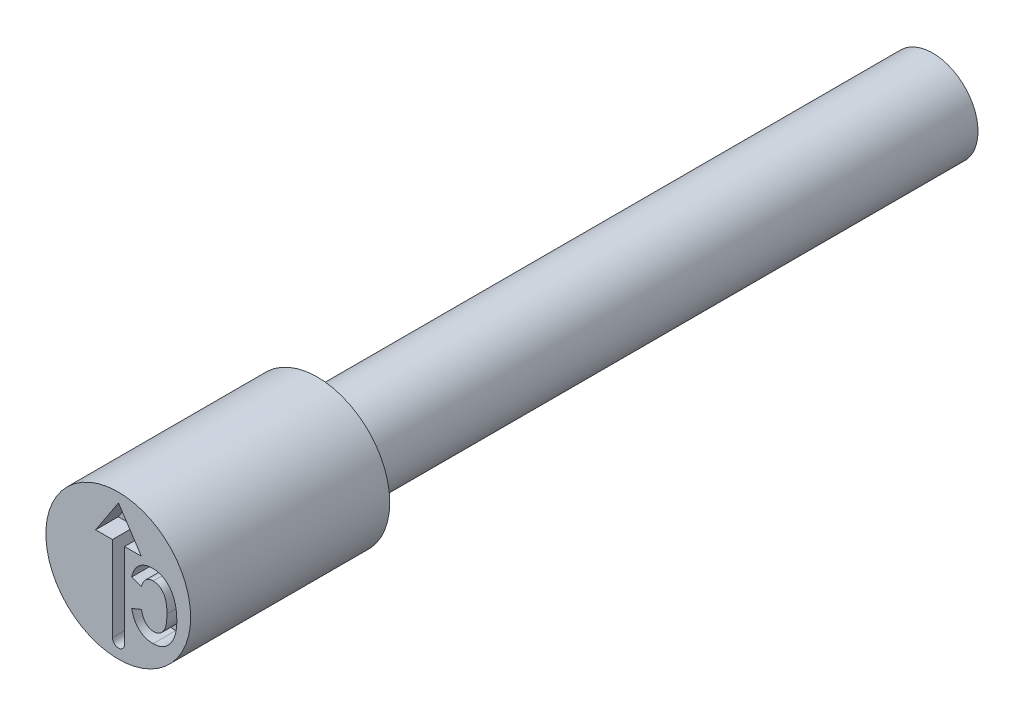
ISO-10303-21;
HEADER;
FILE_DESCRIPTION(('STEP AP214'),'2;1');
FILE_NAME('part.step','',(''),(''),'','','');
FILE_SCHEMA(('AUTOMOTIVE_DESIGN { 1 0 10303 214 1 1 1 1 }'));
ENDSEC;
DATA;
#1=APPLICATION_CONTEXT('core data for automotive mechanical design processes');
#2=APPLICATION_PROTOCOL_DEFINITION('international standard','automotive_design',2000,#1);
#3=PRODUCT_CONTEXT('',#1,'mechanical');
#4=PRODUCT('Part','Part','',(#3));
#5=PRODUCT_RELATED_PRODUCT_CATEGORY('part','',(#4));
#6=PRODUCT_DEFINITION_FORMATION('','',#4);
#7=PRODUCT_DEFINITION_CONTEXT('part definition',#1,'design');
#8=PRODUCT_DEFINITION('design','',#6,#7);
#9=PRODUCT_DEFINITION_SHAPE('','',#8);
#10=(LENGTH_UNIT() NAMED_UNIT(*) SI_UNIT(.MILLI.,.METRE.));
#11=(NAMED_UNIT(*) PLANE_ANGLE_UNIT() SI_UNIT($,.RADIAN.));
#12=(NAMED_UNIT(*) SI_UNIT($,.STERADIAN.) SOLID_ANGLE_UNIT());
#13=UNCERTAINTY_MEASURE_WITH_UNIT(LENGTH_MEASURE(1.E-05),#10,'distance_accuracy_value','');
#14=(GEOMETRIC_REPRESENTATION_CONTEXT(3) GLOBAL_UNCERTAINTY_ASSIGNED_CONTEXT((#13)) GLOBAL_UNIT_ASSIGNED_CONTEXT((#10,
#11,#12)) REPRESENTATION_CONTEXT('',''));
#15=CARTESIAN_POINT('',(0.,0.,0.));
#16=DIRECTION('',(0.,0.,1.));
#17=DIRECTION('',(1.,0.,0.));
#18=AXIS2_PLACEMENT_3D('',#15,#16,#17);
#19=CARTESIAN_POINT('',(0.,0.499999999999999,-2.2));
#20=DIRECTION('',(0.,0.,1.));
#21=DIRECTION('',(1.,0.,0.));
#22=AXIS2_PLACEMENT_3D('',#19,#20,#21);
#23=PLANE('',#22);
#24=CARTESIAN_POINT('',(0.,0.,-2.2));
#25=DIRECTION('',(0.,0.,1.));
#26=DIRECTION('',(1.,0.,0.));
#27=AXIS2_PLACEMENT_3D('',#24,#25,#26);
#28=CIRCLE('',#27,0.8);
#29=CARTESIAN_POINT('',(0.8,0.,-2.2));
#30=VERTEX_POINT('',#29);
#31=EDGE_CURVE('E11',#30,#30,#28,.T.);
#32=ORIENTED_EDGE('',*,*,#31,.F.);
#33=EDGE_LOOP('',(#32));
#34=FACE_BOUND('',#33,.T.);
#35=CARTESIAN_POINT('',(0.,0.,-2.2));
#36=DIRECTION('',(0.,0.,1.));
#37=DIRECTION('',(1.,0.,0.));
#38=AXIS2_PLACEMENT_3D('',#35,#36,#37);
#39=CIRCLE('',#38,0.499999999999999);
#40=CARTESIAN_POINT('',(0.499999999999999,0.,-2.2));
#41=VERTEX_POINT('',#40);
#42=EDGE_CURVE('E266',#41,#41,#39,.T.);
#43=ORIENTED_EDGE('',*,*,#42,.T.);
#44=EDGE_LOOP('',(#43));
#45=FACE_BOUND('',#44,.T.);
#46=ADVANCED_FACE('F35',(#34,#45),#23,.F.);
#47=CARTESIAN_POINT('',(0.,0.,-0.403888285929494));
#48=DIRECTION('',(0.,0.,1.));
#49=DIRECTION('',(1.,0.,0.));
#50=AXIS2_PLACEMENT_3D('',#47,#48,#49);
#51=CYLINDRICAL_SURFACE('',#50,0.8);
#52=CARTESIAN_POINT('',(0.,0.,0.));
#53=DIRECTION('',(0.,0.,1.));
#54=DIRECTION('',(1.,0.,0.));
#55=AXIS2_PLACEMENT_3D('',#52,#53,#54);
#56=CIRCLE('',#55,0.8);
#57=CARTESIAN_POINT('',(0.8,0.,0.));
#58=VERTEX_POINT('',#57);
#59=EDGE_CURVE('E42',#58,#58,#56,.T.);
#60=ORIENTED_EDGE('',*,*,#59,.F.);
#61=EDGE_LOOP('',(#60));
#62=FACE_BOUND('',#61,.T.);
#63=ORIENTED_EDGE('',*,*,#31,.T.);
#64=EDGE_LOOP('',(#63));
#65=FACE_BOUND('',#64,.T.);
#66=ADVANCED_FACE('F251',(#62,#65),#51,.T.);
#67=CARTESIAN_POINT('',(0.,0.8,0.));
#68=DIRECTION('',(0.,0.,-1.));
#69=DIRECTION('',(-1.,0.,0.));
#70=AXIS2_PLACEMENT_3D('',#67,#68,#69);
#71=PLANE('',#70);
#72=DIRECTION('',(-0.923076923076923,-0.384615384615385,0.));
#73=VECTOR('',#72,1.);
#74=CARTESIAN_POINT('',(0.256495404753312,-0.195454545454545,0.));
#75=LINE('',#74,#73);
#76=CARTESIAN_POINT('',(0.256495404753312,-0.195454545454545,0.));
#77=VERTEX_POINT('',#76);
#78=CARTESIAN_POINT('',(0.147404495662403,-0.240909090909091,0.));
#79=VERTEX_POINT('',#78);
#80=EDGE_CURVE('E426',#77,#79,#75,.T.);
#81=ORIENTED_EDGE('',*,*,#80,.F.);
#82=CARTESIAN_POINT('',(0.390444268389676,-0.340909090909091,0.));
#83=CARTESIAN_POINT('',(0.386510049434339,-0.340787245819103,0.));
#84=CARTESIAN_POINT('',(0.378705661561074,-0.340545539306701,0.));
#85=CARTESIAN_POINT('',(0.367221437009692,-0.339006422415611,0.));
#86=CARTESIAN_POINT('',(0.356139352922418,-0.336254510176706,0.));
#87=CARTESIAN_POINT('',(0.345457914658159,-0.332436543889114,0.));
#88=CARTESIAN_POINT('',(0.335222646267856,-0.327399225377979,0.));
#89=CARTESIAN_POINT('',(0.325328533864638,-0.321431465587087,0.));
#90=CARTESIAN_POINT('',(0.315975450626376,-0.31425815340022,0.));
#91=CARTESIAN_POINT('',(0.306920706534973,-0.306113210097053,0.));
#92=CARTESIAN_POINT('',(0.298380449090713,-0.296745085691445,0.));
#93=CARTESIAN_POINT('',(0.290575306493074,-0.285974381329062,0.));
#94=CARTESIAN_POINT('',(0.283323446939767,-0.273993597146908,0.));
#95=CARTESIAN_POINT('',(0.276668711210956,-0.260728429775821,0.));
#96=CARTESIAN_POINT('',(0.270568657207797,-0.246264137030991,0.));
#97=CARTESIAN_POINT('',(0.265190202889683,-0.230489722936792,0.));
#98=CARTESIAN_POINT('',(0.260323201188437,-0.213483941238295,0.));
#99=CARTESIAN_POINT('',(0.257795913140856,-0.201580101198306,0.));
#100=CARTESIAN_POINT('',(0.256495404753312,-0.195454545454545,0.));
#101=B_SPLINE_CURVE_WITH_KNOTS('',3,(#82,#83,#84,#85,#86,#87,#88,#89,#90,#91,#92,#93,#94,#95,
#96,#97,#98,#99,#100),.UNSPECIFIED.,.F.,.F.,(4,1,1,1,1,1,1,1,1,1,1,1,1,1,1,1,4),(0.,
0.0546275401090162,0.108365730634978,0.160503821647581,0.212906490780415,0.26553546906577,
0.318638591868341,0.373071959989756,0.428923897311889,0.48756163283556,0.548703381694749,
0.613306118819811,0.681808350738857,0.754578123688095,0.831085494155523,0.913078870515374,1.),.UNSPECIFIED.);
#102=CARTESIAN_POINT('',(0.390444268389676,-0.340909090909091,0.));
#103=VERTEX_POINT('',#102);
#104=EDGE_CURVE('E49',#103,#77,#101,.T.);
#105=ORIENTED_EDGE('',*,*,#104,.F.);
#106=CARTESIAN_POINT('',(0.538313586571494,-0.0971590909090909,0.));
#107=CARTESIAN_POINT('',(0.538158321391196,-0.107767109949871,0.));
#108=CARTESIAN_POINT('',(0.537859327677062,-0.128194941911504,0.));
#109=CARTESIAN_POINT('',(0.536116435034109,-0.157699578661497,0.));
#110=CARTESIAN_POINT('',(0.532803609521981,-0.184807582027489,0.));
#111=CARTESIAN_POINT('',(0.52856294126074,-0.209625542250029,0.));
#112=CARTESIAN_POINT('',(0.522759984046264,-0.232008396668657,0.));
#113=CARTESIAN_POINT('',(0.515670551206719,-0.251969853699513,0.));
#114=CARTESIAN_POINT('',(0.507504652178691,-0.269704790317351,0.));
#115=CARTESIAN_POINT('',(0.497763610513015,-0.284980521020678,0.));
#116=CARTESIAN_POINT('',(0.486970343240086,-0.298168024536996,0.));
#117=CARTESIAN_POINT('',(0.475495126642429,-0.309617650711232,0.));
#118=CARTESIAN_POINT('',(0.463116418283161,-0.319182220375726,0.));
#119=CARTESIAN_POINT('',(0.450165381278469,-0.327288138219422,0.));
#120=CARTESIAN_POINT('',(0.436286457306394,-0.333430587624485,0.));
#121=CARTESIAN_POINT('',(0.421643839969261,-0.337609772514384,0.));
#122=CARTESIAN_POINT('',(0.406324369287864,-0.340500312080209,0.));
#123=CARTESIAN_POINT('',(0.395808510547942,-0.340771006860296,0.));
#124=CARTESIAN_POINT('',(0.390444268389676,-0.340909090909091,0.));
#125=B_SPLINE_CURVE_WITH_KNOTS('',3,(#106,#107,#108,#109,#110,#111,#112,#113,#114,#115,#116,
#117,#118,#119,#120,#121,#122,#123,#124),.UNSPECIFIED.,.F.,.F.,(4,1,1,1,1,1,1,1,1,1,1,1,1,1,1,1,
4),(0.,0.0992738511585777,0.191171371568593,0.27641034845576,0.354719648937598,
0.426615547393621,0.492483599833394,0.552737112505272,0.608910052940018,0.661501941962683,
0.711944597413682,0.760248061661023,0.807590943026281,0.854603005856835,0.901711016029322,
0.94986183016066,1.),.UNSPECIFIED.);
#126=CARTESIAN_POINT('',(0.538313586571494,-0.0971590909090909,0.));
#127=VERTEX_POINT('',#126);
#128=EDGE_CURVE('E192',#127,#103,#125,.T.);
#129=ORIENTED_EDGE('',*,*,#128,.F.);
#130=CARTESIAN_POINT('',(0.385188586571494,0.140909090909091,0.));
#131=CARTESIAN_POINT('',(0.390689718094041,0.140745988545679,0.));
#132=CARTESIAN_POINT('',(0.401516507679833,0.140424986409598,0.));
#133=CARTESIAN_POINT('',(0.417378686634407,0.137871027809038,0.));
#134=CARTESIAN_POINT('',(0.43238646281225,0.133353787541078,0.));
#135=CARTESIAN_POINT('',(0.446765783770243,0.127423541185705,0.));
#136=CARTESIAN_POINT('',(0.460275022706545,0.11952268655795,0.));
#137=CARTESIAN_POINT('',(0.473064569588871,0.109954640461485,0.));
#138=CARTESIAN_POINT('',(0.484790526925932,0.0984302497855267,0.));
#139=CARTESIAN_POINT('',(0.496028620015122,0.0854672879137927,0.));
#140=CARTESIAN_POINT('',(0.506212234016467,0.0704480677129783,0.));
#141=CARTESIAN_POINT('',(0.514858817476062,0.0530898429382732,0.));
#142=CARTESIAN_POINT('',(0.521990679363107,0.0334545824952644,0.));
#143=CARTESIAN_POINT('',(0.52813393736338,0.0116831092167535,0.));
#144=CARTESIAN_POINT('',(0.532730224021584,-0.0123676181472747,0.));
#145=CARTESIAN_POINT('',(0.535919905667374,-0.0386603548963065,0.));
#146=CARTESIAN_POINT('',(0.537910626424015,-0.0671569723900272,0.));
#147=CARTESIAN_POINT('',(0.538176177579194,-0.0869283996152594,0.));
#148=CARTESIAN_POINT('',(0.538313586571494,-0.0971590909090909,0.));
#149=B_SPLINE_CURVE_WITH_KNOTS('',3,(#130,#131,#132,#133,#134,#135,#136,#137,#138,#139,#140,
#141,#142,#143,#144,#145,#146,#147,#148),.UNSPECIFIED.,.F.,.F.,(4,1,1,1,1,1,1,1,1,1,1,1,1,1,1,1,
4),(0.,0.0517304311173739,0.101810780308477,0.150568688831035,0.198872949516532,
0.247760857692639,0.29737366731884,0.348713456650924,0.402091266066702,0.458540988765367,
0.518889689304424,0.583994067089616,0.65477355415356,0.731460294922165,0.814043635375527,
0.903777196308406,1.),.UNSPECIFIED.);
#150=CARTESIAN_POINT('',(0.385188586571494,0.140909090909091,0.));
#151=VERTEX_POINT('',#150);
#152=EDGE_CURVE('E195',#151,#127,#149,.T.);
#153=ORIENTED_EDGE('',*,*,#152,.F.);
#154=CARTESIAN_POINT('',(0.256495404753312,0.0227272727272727,0.));
#155=CARTESIAN_POINT('',(0.257520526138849,0.0273831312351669,0.));
#156=CARTESIAN_POINT('',(0.25951524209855,0.0364426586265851,0.));
#157=CARTESIAN_POINT('',(0.263520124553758,0.0495167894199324,0.));
#158=CARTESIAN_POINT('',(0.268395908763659,0.0616600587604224,0.));
#159=CARTESIAN_POINT('',(0.273700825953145,0.0731639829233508,0.));
#160=CARTESIAN_POINT('',(0.280088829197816,0.0836306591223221,0.));
#161=CARTESIAN_POINT('',(0.286770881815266,0.0935601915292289,0.));
#162=CARTESIAN_POINT('',(0.294606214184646,0.102357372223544,0.));
#163=CARTESIAN_POINT('',(0.302884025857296,0.110484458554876,0.));
#164=CARTESIAN_POINT('',(0.311896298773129,0.117507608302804,0.));
#165=CARTESIAN_POINT('',(0.321121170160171,0.123858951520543,0.));
#166=CARTESIAN_POINT('',(0.330833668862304,0.129139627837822,0.));
#167=CARTESIAN_POINT('',(0.340993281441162,0.133386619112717,0.));
#168=CARTESIAN_POINT('',(0.351479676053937,0.136823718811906,0.));
#169=CARTESIAN_POINT('',(0.362370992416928,0.139240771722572,0.));
#170=CARTESIAN_POINT('',(0.373642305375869,0.140704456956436,0.));
#171=CARTESIAN_POINT('',(0.381301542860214,0.140840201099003,0.));
#172=CARTESIAN_POINT('',(0.385188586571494,0.140909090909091,0.));
#173=B_SPLINE_CURVE_WITH_KNOTS('',3,(#154,#155,#156,#157,#158,#159,#160,#161,#162,#163,#164,
#165,#166,#167,#168,#169,#170,#171,#172),.UNSPECIFIED.,.F.,.F.,(4,1,1,1,1,1,1,1,1,1,1,1,1,1,1,1,
4),(0.,0.0750044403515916,0.145946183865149,0.214851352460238,0.28084266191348,
0.344991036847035,0.407619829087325,0.468881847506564,0.530007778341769,0.589936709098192,
0.648421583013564,0.706103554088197,0.763534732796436,0.821499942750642,0.879527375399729,
0.938860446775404,1.),.UNSPECIFIED.);
#174=CARTESIAN_POINT('',(0.256495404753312,0.0227272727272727,0.));
#175=VERTEX_POINT('',#174);
#176=EDGE_CURVE('E359',#175,#151,#173,.T.);
#177=ORIENTED_EDGE('',*,*,#176,.F.);
#178=DIRECTION('',(0.948683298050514,-0.316227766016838,0.));
#179=VECTOR('',#178,1.);
#180=CARTESIAN_POINT('',(0.147404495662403,0.0590909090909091,0.));
#181=LINE('',#180,#179);
#182=CARTESIAN_POINT('',(0.147404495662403,0.0590909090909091,0.));
#183=VERTEX_POINT('',#182);
#184=EDGE_CURVE('E367',#183,#175,#181,.T.);
#185=ORIENTED_EDGE('',*,*,#184,.F.);
#186=CARTESIAN_POINT('',(0.215444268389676,0.194744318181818,0.));
#187=CARTESIAN_POINT('',(0.211629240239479,0.190785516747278,0.));
#188=CARTESIAN_POINT('',(0.203855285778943,0.182718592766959,0.));
#189=CARTESIAN_POINT('',(0.19338763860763,0.169130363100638,0.));
#190=CARTESIAN_POINT('',(0.183696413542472,0.154165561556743,0.));
#191=CARTESIAN_POINT('',(0.174955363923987,0.137760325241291,0.));
#192=CARTESIAN_POINT('',(0.166829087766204,0.120074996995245,0.));
#193=CARTESIAN_POINT('',(0.159439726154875,0.101018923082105,0.));
#194=CARTESIAN_POINT('',(0.152939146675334,0.0805487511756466,0.));
#195=CARTESIAN_POINT('',(0.149277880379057,0.0663540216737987,0.));
#196=CARTESIAN_POINT('',(0.147404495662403,0.0590909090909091,0.));
#197=B_SPLINE_CURVE_WITH_KNOTS('',3,(#186,#187,#188,#189,#190,#191,#192,#193,#194,#195,#196),
.UNSPECIFIED.,.F.,.F.,(4,1,1,1,1,1,1,1,4),(0.,0.107250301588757,0.218545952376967,
0.334163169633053,0.454912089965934,0.581044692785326,0.713889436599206,0.853603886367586,1.),.UNSPECIFIED.);
#198=CARTESIAN_POINT('',(0.215444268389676,0.194744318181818,0.));
#199=VERTEX_POINT('',#198);
#200=EDGE_CURVE('E373',#199,#183,#197,.T.);
#201=ORIENTED_EDGE('',*,*,#200,.F.);
#202=CARTESIAN_POINT('',(0.377234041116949,0.259090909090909,0.));
#203=CARTESIAN_POINT('',(0.369318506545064,0.25890144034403,0.));
#204=CARTESIAN_POINT('',(0.353760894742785,0.258529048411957,0.));
#205=CARTESIAN_POINT('',(0.330948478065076,0.255551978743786,0.));
#206=CARTESIAN_POINT('',(0.309214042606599,0.250317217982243,0.));
#207=CARTESIAN_POINT('',(0.288345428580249,0.243450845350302,0.));
#208=CARTESIAN_POINT('',(0.268525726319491,0.234263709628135,0.));
#209=CARTESIAN_POINT('',(0.24969762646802,0.223115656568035,0.));
#210=CARTESIAN_POINT('',(0.231787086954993,0.210043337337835,0.));
#211=CARTESIAN_POINT('',(0.220931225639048,0.199880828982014,0.));
#212=CARTESIAN_POINT('',(0.215444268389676,0.194744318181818,0.));
#213=B_SPLINE_CURVE_WITH_KNOTS('',3,(#202,#203,#204,#205,#206,#207,#208,#209,#210,#211,#212),
.UNSPECIFIED.,.F.,.F.,(4,1,1,1,1,1,1,1,4),(0.,0.13277178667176,0.260956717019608,
0.385037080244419,0.507368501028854,0.62892376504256,0.750714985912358,0.874002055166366,1.),.UNSPECIFIED.);
#214=CARTESIAN_POINT('',(0.377234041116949,0.259090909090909,0.));
#215=VERTEX_POINT('',#214);
#216=EDGE_CURVE('E378',#215,#199,#213,.T.);
#217=ORIENTED_EDGE('',*,*,#216,.F.);
#218=CARTESIAN_POINT('',(0.566438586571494,0.171875,0.));
#219=CARTESIAN_POINT('',(0.560486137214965,0.178840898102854,0.));
#220=CARTESIAN_POINT('',(0.548755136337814,0.192569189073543,0.));
#221=CARTESIAN_POINT('',(0.528704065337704,0.210346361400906,0.));
#222=CARTESIAN_POINT('',(0.507162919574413,0.225457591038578,0.));
#223=CARTESIAN_POINT('',(0.484139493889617,0.237829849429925,0.));
#224=CARTESIAN_POINT('',(0.459530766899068,0.247452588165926,0.));
#225=CARTESIAN_POINT('',(0.433457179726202,0.25424254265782,0.));
#226=CARTESIAN_POINT('',(0.4058143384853,0.258248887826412,0.));
#227=CARTESIAN_POINT('',(0.386906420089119,0.258805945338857,0.));
#228=CARTESIAN_POINT('',(0.377234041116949,0.259090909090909,0.));
#229=B_SPLINE_CURVE_WITH_KNOTS('',3,(#218,#219,#220,#221,#222,#223,#224,#225,#226,#227,#228),
.UNSPECIFIED.,.F.,.F.,(4,1,1,1,1,1,1,1,4),(0.,0.127182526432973,0.250649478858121,
0.371100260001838,0.492067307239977,0.612885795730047,0.737344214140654,0.86563796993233,1.),.UNSPECIFIED.);
#230=CARTESIAN_POINT('',(0.566438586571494,0.171875,0.));
#231=VERTEX_POINT('',#230);
#232=EDGE_CURVE('E386',#231,#215,#229,.T.);
#233=ORIENTED_EDGE('',*,*,#232,.F.);
#234=CARTESIAN_POINT('',(0.647404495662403,-0.106107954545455,0.));
#235=CARTESIAN_POINT('',(0.64717817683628,-0.0917040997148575,0.));
#236=CARTESIAN_POINT('',(0.646737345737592,-0.0636478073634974,0.));
#237=CARTESIAN_POINT('',(0.642768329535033,-0.0228005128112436,0.));
#238=CARTESIAN_POINT('',(0.636717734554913,0.0157087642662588,0.));
#239=CARTESIAN_POINT('',(0.627696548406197,0.0517368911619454,0.));
#240=CARTESIAN_POINT('',(0.616395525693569,0.0854907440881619,0.));
#241=CARTESIAN_POINT('',(0.602433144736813,0.116759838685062,0.));
#242=CARTESIAN_POINT('',(0.586221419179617,0.145871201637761,0.));
#243=CARTESIAN_POINT('',(0.572994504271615,0.163257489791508,0.));
#244=CARTESIAN_POINT('',(0.566438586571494,0.171875,0.));
#245=B_SPLINE_CURVE_WITH_KNOTS('',3,(#234,#235,#236,#237,#238,#239,#240,#241,#242,#243,#244),
.UNSPECIFIED.,.F.,.F.,(4,1,1,1,1,1,1,1,4),(0.,0.146387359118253,0.285138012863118,
0.416810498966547,0.542304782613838,0.662246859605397,0.778169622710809,0.89004981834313,1.),.UNSPECIFIED.);
#246=CARTESIAN_POINT('',(0.647404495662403,-0.106107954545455,0.));
#247=VERTEX_POINT('',#246);
#248=EDGE_CURVE('E394',#247,#231,#245,.T.);
#249=ORIENTED_EDGE('',*,*,#248,.F.);
#250=CARTESIAN_POINT('',(0.567148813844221,-0.373295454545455,0.));
#251=CARTESIAN_POINT('',(0.573580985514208,-0.364802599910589,0.));
#252=CARTESIAN_POINT('',(0.586539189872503,-0.347692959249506,0.));
#253=CARTESIAN_POINT('',(0.602807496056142,-0.319479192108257,0.));
#254=CARTESIAN_POINT('',(0.61664400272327,-0.289168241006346,0.));
#255=CARTESIAN_POINT('',(0.627968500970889,-0.256732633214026,0.));
#256=CARTESIAN_POINT('',(0.636795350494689,-0.22213643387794,0.));
#257=CARTESIAN_POINT('',(0.642966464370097,-0.185363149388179,0.));
#258=CARTESIAN_POINT('',(0.646672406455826,-0.146430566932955,0.));
#259=CARTESIAN_POINT('',(0.64715676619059,-0.119752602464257,0.));
#260=CARTESIAN_POINT('',(0.647404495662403,-0.106107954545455,0.));
#261=B_SPLINE_CURVE_WITH_KNOTS('',3,(#250,#251,#252,#253,#254,#255,#256,#257,#258,#259,#260),
.UNSPECIFIED.,.F.,.F.,(4,1,1,1,1,1,1,1,4),(0.,0.112267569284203,0.226173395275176,
0.342589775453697,0.463245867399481,0.587990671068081,0.71868225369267,0.856117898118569,1.),.UNSPECIFIED.);
#262=CARTESIAN_POINT('',(0.567148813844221,-0.373295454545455,0.));
#263=VERTEX_POINT('',#262);
#264=EDGE_CURVE('E402',#263,#247,#261,.T.);
#265=ORIENTED_EDGE('',*,*,#264,.F.);
#266=CARTESIAN_POINT('',(0.385188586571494,-0.459090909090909,0.));
#267=CARTESIAN_POINT('',(0.39434478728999,-0.45888505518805,0.));
#268=CARTESIAN_POINT('',(0.412281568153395,-0.458481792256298,0.));
#269=CARTESIAN_POINT('',(0.438454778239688,-0.454142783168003,0.));
#270=CARTESIAN_POINT('',(0.463360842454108,-0.447550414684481,0.));
#271=CARTESIAN_POINT('',(0.486954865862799,-0.438083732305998,0.));
#272=CARTESIAN_POINT('',(0.50926482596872,-0.425983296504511,0.));
#273=CARTESIAN_POINT('',(0.530055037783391,-0.410995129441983,0.));
#274=CARTESIAN_POINT('',(0.54981062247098,-0.393677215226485,0.));
#275=CARTESIAN_POINT('',(0.561297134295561,-0.38017434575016,0.));
#276=CARTESIAN_POINT('',(0.567148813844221,-0.373295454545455,0.));
#277=B_SPLINE_CURVE_WITH_KNOTS('',3,(#266,#267,#268,#269,#270,#271,#272,#273,#274,#275,#276),
.UNSPECIFIED.,.F.,.F.,(4,1,1,1,1,1,1,1,4),(0.,0.131676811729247,0.257951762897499,
0.380786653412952,0.501900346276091,0.622975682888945,0.745141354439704,0.870165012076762,1.),.UNSPECIFIED.);
#278=CARTESIAN_POINT('',(0.385188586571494,-0.459090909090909,0.));
#279=VERTEX_POINT('',#278);
#280=EDGE_CURVE('E410',#279,#263,#277,.T.);
#281=ORIENTED_EDGE('',*,*,#280,.F.);
#282=CARTESIAN_POINT('',(0.147404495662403,-0.240909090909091,0.));
#283=CARTESIAN_POINT('',(0.149657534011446,-0.250079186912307,0.));
#284=CARTESIAN_POINT('',(0.154047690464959,-0.267947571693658,0.));
#285=CARTESIAN_POINT('',(0.162353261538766,-0.293486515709,0.));
#286=CARTESIAN_POINT('',(0.17149259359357,-0.317182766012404,0.));
#287=CARTESIAN_POINT('',(0.181948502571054,-0.338903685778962,0.));
#288=CARTESIAN_POINT('',(0.193362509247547,-0.358839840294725,0.));
#289=CARTESIAN_POINT('',(0.206041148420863,-0.376795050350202,0.));
#290=CARTESIAN_POINT('',(0.219745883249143,-0.392861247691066,0.));
#291=CARTESIAN_POINT('',(0.234554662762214,-0.407000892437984,0.));
#292=CARTESIAN_POINT('',(0.250443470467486,-0.419166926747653,0.));
#293=CARTESIAN_POINT('',(0.266966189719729,-0.430008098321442,0.));
#294=CARTESIAN_POINT('',(0.284549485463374,-0.438895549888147,0.));
#295=CARTESIAN_POINT('',(0.302947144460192,-0.446399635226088,0.));
#296=CARTESIAN_POINT('',(0.322303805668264,-0.451977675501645,0.));
#297=CARTESIAN_POINT('',(0.342472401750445,-0.456175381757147,0.));
#298=CARTESIAN_POINT('',(0.363539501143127,-0.458577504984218,0.));
#299=CARTESIAN_POINT('',(0.377891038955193,-0.458917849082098,0.));
#300=CARTESIAN_POINT('',(0.385188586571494,-0.459090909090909,0.));
#301=B_SPLINE_CURVE_WITH_KNOTS('',3,(#282,#283,#284,#285,#286,#287,#288,#289,#290,#291,#292,
#293,#294,#295,#296,#297,#298,#299,#300),.UNSPECIFIED.,.F.,.F.,(4,1,1,1,1,1,1,1,1,1,1,1,1,1,1,1,
4),(0.,0.080161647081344,0.156198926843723,0.227877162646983,0.295674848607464,0.36070738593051,
0.422732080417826,0.482042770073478,0.539774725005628,0.596232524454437,0.651772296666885,
0.707336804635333,0.763259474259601,0.820257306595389,0.878136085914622,0.938033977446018,1.),.UNSPECIFIED.);
#302=EDGE_CURVE('E418',#79,#279,#301,.T.);
#303=ORIENTED_EDGE('',*,*,#302,.F.);
#304=EDGE_LOOP('',(#81,#105,#129,#153,#177,#185,#201,#217,#233,#249,#265,#281,#303));
#305=FACE_BOUND('',#304,.T.);
#306=DIRECTION('',(0.,1.,0.));
#307=VECTOR('',#306,1.);
#308=CARTESIAN_POINT('',(0.0691688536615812,0.312374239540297,0.));
#309=LINE('',#308,#307);
#310=CARTESIAN_POINT('',(0.0691688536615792,-0.626505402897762,0.));
#311=VERTEX_POINT('',#310);
#312=CARTESIAN_POINT('',(0.0691688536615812,0.312374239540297,0.));
#313=VERTEX_POINT('',#312);
#314=EDGE_CURVE('E304',#311,#313,#309,.T.);
#315=ORIENTED_EDGE('',*,*,#314,.F.);
#316=CARTESIAN_POINT('',(0.00250326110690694,-0.626505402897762,0.));
#317=DIRECTION('',(0.,0.,1.));
#318=DIRECTION('',(1.,0.,0.));
#319=AXIS2_PLACEMENT_3D('',#316,#317,#318);
#320=CIRCLE('',#319,0.0666655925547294);
#321=CARTESIAN_POINT('',(-0.0641623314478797,-0.626505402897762,0.));
#322=VERTEX_POINT('',#321);
#323=EDGE_CURVE('E57',#322,#311,#320,.T.);
#324=ORIENTED_EDGE('',*,*,#323,.F.);
#325=DIRECTION('',(0.,-1.,0.));
#326=VECTOR('',#325,1.);
#327=CARTESIAN_POINT('',(-0.0641623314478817,0.312374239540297,0.));
#328=LINE('',#327,#326);
#329=CARTESIAN_POINT('',(-0.0641623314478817,0.312374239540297,0.));
#330=VERTEX_POINT('',#329);
#331=EDGE_CURVE('E288',#330,#322,#328,.T.);
#332=ORIENTED_EDGE('',*,*,#331,.F.);
#333=DIRECTION('',(1.,0.,0.));
#334=VECTOR('',#333,1.);
#335=CARTESIAN_POINT('',(-0.250167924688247,0.312374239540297,0.));
#336=LINE('',#335,#334);
#337=CARTESIAN_POINT('',(-0.250167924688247,0.312374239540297,0.));
#338=VERTEX_POINT('',#337);
#339=EDGE_CURVE('E292',#338,#330,#336,.T.);
#340=ORIENTED_EDGE('',*,*,#339,.F.);
#341=DIRECTION('',(-0.550159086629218,-0.835059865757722,0.));
#342=VECTOR('',#341,1.);
#343=CARTESIAN_POINT('',(0.00250326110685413,0.69589161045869,0.));
#344=LINE('',#343,#342);
#345=CARTESIAN_POINT('',(0.00250326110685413,0.69589161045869,0.));
#346=VERTEX_POINT('',#345);
#347=EDGE_CURVE('E295',#346,#338,#344,.T.);
#348=ORIENTED_EDGE('',*,*,#347,.F.);
#349=DIRECTION('',(-0.550159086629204,0.835059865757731,0.));
#350=VECTOR('',#349,1.);
#351=CARTESIAN_POINT('',(0.00250326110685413,0.69589161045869,0.));
#352=LINE('',#351,#350);
#353=CARTESIAN_POINT('',(0.255174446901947,0.312374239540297,0.));
#354=VERTEX_POINT('',#353);
#355=EDGE_CURVE('E298',#354,#346,#352,.T.);
#356=ORIENTED_EDGE('',*,*,#355,.F.);
#357=DIRECTION('',(1.,0.,0.));
#358=VECTOR('',#357,1.);
#359=CARTESIAN_POINT('',(0.255174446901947,0.312374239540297,0.));
#360=LINE('',#359,#358);
#361=EDGE_CURVE('E301',#313,#354,#360,.T.);
#362=ORIENTED_EDGE('',*,*,#361,.F.);
#363=EDGE_LOOP('',(#315,#324,#332,#340,#348,#356,#362));
#364=FACE_BOUND('',#363,.T.);
#365=ORIENTED_EDGE('',*,*,#59,.T.);
#366=EDGE_LOOP('',(#365));
#367=FACE_BOUND('',#366,.T.);
#368=ADVANCED_FACE('F248',(#305,#364,#367),#71,.F.);
#369=CARTESIAN_POINT('',(0.,0.,-9.));
#370=DIRECTION('',(0.,0.,1.));
#371=DIRECTION('',(1.,0.,0.));
#372=AXIS2_PLACEMENT_3D('',#369,#370,#371);
#373=PLANE('',#372);
#374=CARTESIAN_POINT('',(0.,0.,-9.));
#375=DIRECTION('',(0.,0.,1.));
#376=DIRECTION('',(1.,0.,0.));
#377=AXIS2_PLACEMENT_3D('',#374,#375,#376);
#378=CIRCLE('',#377,0.5);
#379=CARTESIAN_POINT('',(0.5,0.,-9.));
#380=VERTEX_POINT('',#379);
#381=EDGE_CURVE('E267',#380,#380,#378,.T.);
#382=ORIENTED_EDGE('',*,*,#381,.F.);
#383=EDGE_LOOP('',(#382));
#384=FACE_BOUND('',#383,.T.);
#385=ADVANCED_FACE('F244',(#384),#373,.F.);
#386=CARTESIAN_POINT('',(0.,0.,-0.403888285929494));
#387=DIRECTION('',(0.,0.,1.));
#388=DIRECTION('',(1.,0.,0.));
#389=AXIS2_PLACEMENT_3D('',#386,#387,#388);
#390=CYLINDRICAL_SURFACE('',#389,0.5);
#391=ORIENTED_EDGE('',*,*,#42,.F.);
#392=EDGE_LOOP('',(#391));
#393=FACE_BOUND('',#392,.T.);
#394=ORIENTED_EDGE('',*,*,#381,.T.);
#395=EDGE_LOOP('',(#394));
#396=FACE_BOUND('',#395,.T.);
#397=ADVANCED_FACE('F241',(#393,#396),#390,.T.);
#398=CARTESIAN_POINT('',(0.00250326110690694,-0.626505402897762,-0.25));
#399=DIRECTION('',(0.,0.,1.));
#400=DIRECTION('',(1.,0.,0.));
#401=AXIS2_PLACEMENT_3D('',#398,#399,#400);
#402=CYLINDRICAL_SURFACE('',#401,0.0666655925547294);
#403=ORIENTED_EDGE('',*,*,#323,.T.);
#404=DIRECTION('',(0.,0.,1.));
#405=VECTOR('',#404,1.);
#406=CARTESIAN_POINT('',(0.0691688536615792,-0.626505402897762,-0.25));
#407=LINE('',#406,#405);
#408=CARTESIAN_POINT('',(0.0691688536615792,-0.626505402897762,-0.25));
#409=VERTEX_POINT('',#408);
#410=EDGE_CURVE('E275',#409,#311,#407,.T.);
#411=ORIENTED_EDGE('',*,*,#410,.F.);
#412=CARTESIAN_POINT('',(0.00250326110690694,-0.626505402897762,-0.25));
#413=DIRECTION('',(0.,0.,1.));
#414=DIRECTION('',(1.,0.,0.));
#415=AXIS2_PLACEMENT_3D('',#412,#413,#414);
#416=CIRCLE('',#415,0.0666655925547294);
#417=CARTESIAN_POINT('',(-0.0641623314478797,-0.626505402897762,-0.25));
#418=VERTEX_POINT('',#417);
#419=EDGE_CURVE('E291',#418,#409,#416,.T.);
#420=ORIENTED_EDGE('',*,*,#419,.F.);
#421=DIRECTION('',(0.,0.,1.));
#422=VECTOR('',#421,1.);
#423=CARTESIAN_POINT('',(-0.0641623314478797,-0.626505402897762,-0.25));
#424=LINE('',#423,#422);
#425=EDGE_CURVE('E268',#418,#322,#424,.T.);
#426=ORIENTED_EDGE('',*,*,#425,.T.);
#427=EDGE_LOOP('',(#403,#411,#420,#426));
#428=FACE_BOUND('',#427,.T.);
#429=ADVANCED_FACE('F219',(#428),#402,.F.);
#430=CARTESIAN_POINT('',(-0.0641623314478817,0.312374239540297,-0.25));
#431=DIRECTION('',(-1.,0.,0.));
#432=DIRECTION('',(0.,-1.,0.));
#433=AXIS2_PLACEMENT_3D('',#430,#431,#432);
#434=PLANE('',#433);
#435=ORIENTED_EDGE('',*,*,#331,.T.);
#436=ORIENTED_EDGE('',*,*,#425,.F.);
#437=DIRECTION('',(0.,-1.,0.));
#438=VECTOR('',#437,1.);
#439=CARTESIAN_POINT('',(-0.0641623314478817,0.312374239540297,-0.25));
#440=LINE('',#439,#438);
#441=CARTESIAN_POINT('',(-0.0641623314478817,0.312374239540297,-0.25));
#442=VERTEX_POINT('',#441);
#443=EDGE_CURVE('E279',#442,#418,#440,.T.);
#444=ORIENTED_EDGE('',*,*,#443,.F.);
#445=DIRECTION('',(0.,0.,1.));
#446=VECTOR('',#445,1.);
#447=CARTESIAN_POINT('',(-0.0641623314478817,0.312374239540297,-0.25));
#448=LINE('',#447,#446);
#449=EDGE_CURVE('E272',#442,#330,#448,.T.);
#450=ORIENTED_EDGE('',*,*,#449,.T.);
#451=EDGE_LOOP('',(#435,#436,#444,#450));
#452=FACE_BOUND('',#451,.T.);
#453=ADVANCED_FACE('F215',(#452),#434,.F.);
#454=CARTESIAN_POINT('',(-0.250167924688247,0.312374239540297,-0.25));
#455=DIRECTION('',(0.,-1.,0.));
#456=DIRECTION('',(0.,0.,-1.));
#457=AXIS2_PLACEMENT_3D('',#454,#455,#456);
#458=PLANE('',#457);
#459=ORIENTED_EDGE('',*,*,#339,.T.);
#460=ORIENTED_EDGE('',*,*,#449,.F.);
#461=DIRECTION('',(1.,0.,0.));
#462=VECTOR('',#461,1.);
#463=CARTESIAN_POINT('',(-0.250167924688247,0.312374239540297,-0.25));
#464=LINE('',#463,#462);
#465=CARTESIAN_POINT('',(-0.250167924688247,0.312374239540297,-0.25));
#466=VERTEX_POINT('',#465);
#467=EDGE_CURVE('E311',#466,#442,#464,.T.);
#468=ORIENTED_EDGE('',*,*,#467,.F.);
#469=DIRECTION('',(0.,0.,1.));
#470=VECTOR('',#469,1.);
#471=CARTESIAN_POINT('',(-0.250167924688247,0.312374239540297,-0.25));
#472=LINE('',#471,#470);
#473=EDGE_CURVE('E285',#466,#338,#472,.T.);
#474=ORIENTED_EDGE('',*,*,#473,.T.);
#475=EDGE_LOOP('',(#459,#460,#468,#474));
#476=FACE_BOUND('',#475,.T.);
#477=ADVANCED_FACE('F218',(#476),#458,.F.);
#478=CARTESIAN_POINT('',(0.00250326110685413,0.69589161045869,-0.25));
#479=DIRECTION('',(-0.835059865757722,0.550159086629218,0.));
#480=DIRECTION('',(-0.550159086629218,-0.835059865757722,0.));
#481=AXIS2_PLACEMENT_3D('',#478,#479,#480);
#482=PLANE('',#481);
#483=ORIENTED_EDGE('',*,*,#347,.T.);
#484=ORIENTED_EDGE('',*,*,#473,.F.);
#485=DIRECTION('',(-0.550159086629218,-0.835059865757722,0.));
#486=VECTOR('',#485,1.);
#487=CARTESIAN_POINT('',(0.00250326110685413,0.69589161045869,-0.25));
#488=LINE('',#487,#486);
#489=CARTESIAN_POINT('',(0.00250326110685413,0.69589161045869,-0.25));
#490=VERTEX_POINT('',#489);
#491=EDGE_CURVE('E314',#490,#466,#488,.T.);
#492=ORIENTED_EDGE('',*,*,#491,.F.);
#493=DIRECTION('',(0.,0.,1.));
#494=VECTOR('',#493,1.);
#495=CARTESIAN_POINT('',(0.00250326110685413,0.69589161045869,-0.25));
#496=LINE('',#495,#494);
#497=EDGE_CURVE('E283',#490,#346,#496,.T.);
#498=ORIENTED_EDGE('',*,*,#497,.T.);
#499=EDGE_LOOP('',(#483,#484,#492,#498));
#500=FACE_BOUND('',#499,.T.);
#501=ADVANCED_FACE('F223',(#500),#482,.F.);
#502=CARTESIAN_POINT('',(0.00250326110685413,0.69589161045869,-0.25));
#503=DIRECTION('',(0.835059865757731,0.550159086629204,0.));
#504=DIRECTION('',(-0.550159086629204,0.835059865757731,0.));
#505=AXIS2_PLACEMENT_3D('',#502,#503,#504);
#506=PLANE('',#505);
#507=ORIENTED_EDGE('',*,*,#355,.T.);
#508=ORIENTED_EDGE('',*,*,#497,.F.);
#509=DIRECTION('',(-0.550159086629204,0.835059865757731,0.));
#510=VECTOR('',#509,1.);
#511=CARTESIAN_POINT('',(0.00250326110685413,0.69589161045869,-0.25));
#512=LINE('',#511,#510);
#513=CARTESIAN_POINT('',(0.255174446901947,0.312374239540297,-0.25));
#514=VERTEX_POINT('',#513);
#515=EDGE_CURVE('E317',#514,#490,#512,.T.);
#516=ORIENTED_EDGE('',*,*,#515,.F.);
#517=DIRECTION('',(0.,0.,1.));
#518=VECTOR('',#517,1.);
#519=CARTESIAN_POINT('',(0.255174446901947,0.312374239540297,-0.25));
#520=LINE('',#519,#518);
#521=EDGE_CURVE('E281',#514,#354,#520,.T.);
#522=ORIENTED_EDGE('',*,*,#521,.T.);
#523=EDGE_LOOP('',(#507,#508,#516,#522));
#524=FACE_BOUND('',#523,.T.);
#525=ADVANCED_FACE('F227',(#524),#506,.F.);
#526=CARTESIAN_POINT('',(0.255174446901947,0.312374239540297,-0.25));
#527=DIRECTION('',(0.,-1.,0.));
#528=DIRECTION('',(0.,0.,-1.));
#529=AXIS2_PLACEMENT_3D('',#526,#527,#528);
#530=PLANE('',#529);
#531=ORIENTED_EDGE('',*,*,#361,.T.);
#532=ORIENTED_EDGE('',*,*,#521,.F.);
#533=DIRECTION('',(1.,0.,0.));
#534=VECTOR('',#533,1.);
#535=CARTESIAN_POINT('',(0.255174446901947,0.312374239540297,-0.25));
#536=LINE('',#535,#534);
#537=CARTESIAN_POINT('',(0.0691688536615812,0.312374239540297,-0.25));
#538=VERTEX_POINT('',#537);
#539=EDGE_CURVE('E320',#538,#514,#536,.T.);
#540=ORIENTED_EDGE('',*,*,#539,.F.);
#541=DIRECTION('',(0.,0.,1.));
#542=VECTOR('',#541,1.);
#543=CARTESIAN_POINT('',(0.0691688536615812,0.312374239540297,-0.25));
#544=LINE('',#543,#542);
#545=EDGE_CURVE('E278',#538,#313,#544,.T.);
#546=ORIENTED_EDGE('',*,*,#545,.T.);
#547=EDGE_LOOP('',(#531,#532,#540,#546));
#548=FACE_BOUND('',#547,.T.);
#549=ADVANCED_FACE('F231',(#548),#530,.F.);
#550=CARTESIAN_POINT('',(0.0691688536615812,0.312374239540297,-0.25));
#551=DIRECTION('',(1.,0.,0.));
#552=DIRECTION('',(0.,1.,0.));
#553=AXIS2_PLACEMENT_3D('',#550,#551,#552);
#554=PLANE('',#553);
#555=ORIENTED_EDGE('',*,*,#314,.T.);
#556=ORIENTED_EDGE('',*,*,#545,.F.);
#557=DIRECTION('',(0.,1.,0.));
#558=VECTOR('',#557,1.);
#559=CARTESIAN_POINT('',(0.0691688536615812,0.312374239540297,-0.25));
#560=LINE('',#559,#558);
#561=EDGE_CURVE('E323',#409,#538,#560,.T.);
#562=ORIENTED_EDGE('',*,*,#561,.F.);
#563=ORIENTED_EDGE('',*,*,#410,.T.);
#564=EDGE_LOOP('',(#555,#556,#562,#563));
#565=FACE_BOUND('',#564,.T.);
#566=ADVANCED_FACE('F213',(#565),#554,.F.);
#567=CARTESIAN_POINT('',(0.00250326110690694,-0.626505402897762,-0.25));
#568=DIRECTION('',(0.,0.,1.));
#569=DIRECTION('',(1.,0.,0.));
#570=AXIS2_PLACEMENT_3D('',#567,#568,#569);
#571=PLANE('',#570);
#572=ORIENTED_EDGE('',*,*,#419,.T.);
#573=ORIENTED_EDGE('',*,*,#561,.T.);
#574=ORIENTED_EDGE('',*,*,#539,.T.);
#575=ORIENTED_EDGE('',*,*,#515,.T.);
#576=ORIENTED_EDGE('',*,*,#491,.T.);
#577=ORIENTED_EDGE('',*,*,#467,.T.);
#578=ORIENTED_EDGE('',*,*,#443,.T.);
#579=EDGE_LOOP('',(#572,#573,#574,#575,#576,#577,#578));
#580=FACE_BOUND('',#579,.T.);
#581=ADVANCED_FACE('F209',(#580),#571,.T.);
#582=CARTESIAN_POINT('',(0.390444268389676,-0.340909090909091,-0.25));
#583=CARTESIAN_POINT('',(0.386510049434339,-0.340787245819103,-0.25));
#584=CARTESIAN_POINT('',(0.378705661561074,-0.340545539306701,-0.25));
#585=CARTESIAN_POINT('',(0.367221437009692,-0.339006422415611,-0.25));
#586=CARTESIAN_POINT('',(0.356139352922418,-0.336254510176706,-0.25));
#587=CARTESIAN_POINT('',(0.345457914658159,-0.332436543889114,-0.25));
#588=CARTESIAN_POINT('',(0.335222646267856,-0.327399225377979,-0.25));
#589=CARTESIAN_POINT('',(0.325328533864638,-0.321431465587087,-0.25));
#590=CARTESIAN_POINT('',(0.315975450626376,-0.31425815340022,-0.25));
#591=CARTESIAN_POINT('',(0.306920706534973,-0.306113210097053,-0.25));
#592=CARTESIAN_POINT('',(0.298380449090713,-0.296745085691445,-0.25));
#593=CARTESIAN_POINT('',(0.290575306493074,-0.285974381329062,-0.25));
#594=CARTESIAN_POINT('',(0.283323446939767,-0.273993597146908,-0.25));
#595=CARTESIAN_POINT('',(0.276668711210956,-0.260728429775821,-0.25));
#596=CARTESIAN_POINT('',(0.270568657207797,-0.246264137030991,-0.25));
#597=CARTESIAN_POINT('',(0.265190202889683,-0.230489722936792,-0.25));
#598=CARTESIAN_POINT('',(0.260323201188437,-0.213483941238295,-0.25));
#599=CARTESIAN_POINT('',(0.257795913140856,-0.201580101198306,-0.25));
#600=CARTESIAN_POINT('',(0.256495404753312,-0.195454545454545,-0.25));
#601=B_SPLINE_CURVE_WITH_KNOTS('',3,(#582,#583,#584,#585,#586,#587,#588,#589,#590,#591,#592,
#593,#594,#595,#596,#597,#598,#599,#600),.UNSPECIFIED.,.F.,.F.,(4,1,1,1,1,1,1,1,1,1,1,1,1,1,1,1,
4),(0.,0.0546275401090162,0.108365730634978,0.160503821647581,0.212906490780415,
0.26553546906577,0.318638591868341,0.373071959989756,0.428923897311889,0.48756163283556,
0.548703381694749,0.613306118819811,0.681808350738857,0.754578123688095,0.831085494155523,
0.913078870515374,1.),.UNSPECIFIED.);
#602=DIRECTION('',(0.,0.,1.));
#603=VECTOR('',#602,1.);
#604=SURFACE_OF_LINEAR_EXTRUSION('',#601,#603);
#605=ORIENTED_EDGE('',*,*,#104,.T.);
#606=DIRECTION('',(0.,0.,1.));
#607=VECTOR('',#606,1.);
#608=CARTESIAN_POINT('',(0.256495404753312,-0.195454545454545,-0.25));
#609=LINE('',#608,#607);
#610=CARTESIAN_POINT('',(0.256495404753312,-0.195454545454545,-0.25));
#611=VERTEX_POINT('',#610);
#612=EDGE_CURVE('E169',#611,#77,#609,.T.);
#613=ORIENTED_EDGE('',*,*,#612,.F.);
#614=CARTESIAN_POINT('',(0.390444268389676,-0.340909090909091,-0.25));
#615=VERTEX_POINT('',#614);
#616=EDGE_CURVE('E173',#615,#611,#601,.T.);
#617=ORIENTED_EDGE('',*,*,#616,.F.);
#618=DIRECTION('',(0.,0.,1.));
#619=VECTOR('',#618,1.);
#620=CARTESIAN_POINT('',(0.390444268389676,-0.340909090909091,-0.25));
#621=LINE('',#620,#619);
#622=EDGE_CURVE('E308',#615,#103,#621,.T.);
#623=ORIENTED_EDGE('',*,*,#622,.T.);
#624=EDGE_LOOP('',(#605,#613,#617,#623));
#625=FACE_BOUND('',#624,.T.);
#626=ADVANCED_FACE('F171',(#625),#604,.F.);
#627=CARTESIAN_POINT('',(0.538313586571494,-0.0971590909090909,-0.25));
#628=CARTESIAN_POINT('',(0.538158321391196,-0.107767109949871,-0.25));
#629=CARTESIAN_POINT('',(0.537859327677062,-0.128194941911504,-0.25));
#630=CARTESIAN_POINT('',(0.536116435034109,-0.157699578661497,-0.25));
#631=CARTESIAN_POINT('',(0.532803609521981,-0.184807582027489,-0.25));
#632=CARTESIAN_POINT('',(0.52856294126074,-0.209625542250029,-0.25));
#633=CARTESIAN_POINT('',(0.522759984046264,-0.232008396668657,-0.25));
#634=CARTESIAN_POINT('',(0.515670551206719,-0.251969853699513,-0.25));
#635=CARTESIAN_POINT('',(0.507504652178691,-0.269704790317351,-0.25));
#636=CARTESIAN_POINT('',(0.497763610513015,-0.284980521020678,-0.25));
#637=CARTESIAN_POINT('',(0.486970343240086,-0.298168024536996,-0.25));
#638=CARTESIAN_POINT('',(0.475495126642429,-0.309617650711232,-0.25));
#639=CARTESIAN_POINT('',(0.463116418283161,-0.319182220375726,-0.25));
#640=CARTESIAN_POINT('',(0.450165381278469,-0.327288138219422,-0.25));
#641=CARTESIAN_POINT('',(0.436286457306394,-0.333430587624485,-0.25));
#642=CARTESIAN_POINT('',(0.421643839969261,-0.337609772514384,-0.25));
#643=CARTESIAN_POINT('',(0.406324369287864,-0.340500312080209,-0.25));
#644=CARTESIAN_POINT('',(0.395808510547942,-0.340771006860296,-0.25));
#645=CARTESIAN_POINT('',(0.390444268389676,-0.340909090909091,-0.25));
#646=B_SPLINE_CURVE_WITH_KNOTS('',3,(#627,#628,#629,#630,#631,#632,#633,#634,#635,#636,#637,
#638,#639,#640,#641,#642,#643,#644,#645),.UNSPECIFIED.,.F.,.F.,(4,1,1,1,1,1,1,1,1,1,1,1,1,1,1,1,
4),(0.,0.0992738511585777,0.191171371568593,0.27641034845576,0.354719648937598,
0.426615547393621,0.492483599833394,0.552737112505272,0.608910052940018,0.661501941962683,
0.711944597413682,0.760248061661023,0.807590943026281,0.854603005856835,0.901711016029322,
0.94986183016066,1.),.UNSPECIFIED.);
#647=DIRECTION('',(0.,0.,1.));
#648=VECTOR('',#647,1.);
#649=SURFACE_OF_LINEAR_EXTRUSION('',#646,#648);
#650=ORIENTED_EDGE('',*,*,#128,.T.);
#651=ORIENTED_EDGE('',*,*,#622,.F.);
#652=CARTESIAN_POINT('',(0.538313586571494,-0.0971590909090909,-0.25));
#653=VERTEX_POINT('',#652);
#654=EDGE_CURVE('E179',#653,#615,#646,.T.);
#655=ORIENTED_EDGE('',*,*,#654,.F.);
#656=DIRECTION('',(0.,0.,1.));
#657=VECTOR('',#656,1.);
#658=CARTESIAN_POINT('',(0.538313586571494,-0.0971590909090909,-0.25));
#659=LINE('',#658,#657);
#660=EDGE_CURVE('E347',#653,#127,#659,.T.);
#661=ORIENTED_EDGE('',*,*,#660,.T.);
#662=EDGE_LOOP('',(#650,#651,#655,#661));
#663=FACE_BOUND('',#662,.T.);
#664=ADVANCED_FACE('F208',(#663),#649,.F.);
#665=CARTESIAN_POINT('',(0.385188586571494,0.140909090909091,-0.25));
#666=CARTESIAN_POINT('',(0.390689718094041,0.140745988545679,-0.25));
#667=CARTESIAN_POINT('',(0.401516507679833,0.140424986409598,-0.25));
#668=CARTESIAN_POINT('',(0.417378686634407,0.137871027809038,-0.25));
#669=CARTESIAN_POINT('',(0.43238646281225,0.133353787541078,-0.25));
#670=CARTESIAN_POINT('',(0.446765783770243,0.127423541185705,-0.25));
#671=CARTESIAN_POINT('',(0.460275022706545,0.11952268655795,-0.25));
#672=CARTESIAN_POINT('',(0.473064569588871,0.109954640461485,-0.25));
#673=CARTESIAN_POINT('',(0.484790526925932,0.0984302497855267,-0.25));
#674=CARTESIAN_POINT('',(0.496028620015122,0.0854672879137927,-0.25));
#675=CARTESIAN_POINT('',(0.506212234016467,0.0704480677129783,-0.25));
#676=CARTESIAN_POINT('',(0.514858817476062,0.0530898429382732,-0.25));
#677=CARTESIAN_POINT('',(0.521990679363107,0.0334545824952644,-0.25));
#678=CARTESIAN_POINT('',(0.52813393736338,0.0116831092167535,-0.25));
#679=CARTESIAN_POINT('',(0.532730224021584,-0.0123676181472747,-0.25));
#680=CARTESIAN_POINT('',(0.535919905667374,-0.0386603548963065,-0.25));
#681=CARTESIAN_POINT('',(0.537910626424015,-0.0671569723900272,-0.25));
#682=CARTESIAN_POINT('',(0.538176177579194,-0.0869283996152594,-0.25));
#683=CARTESIAN_POINT('',(0.538313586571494,-0.0971590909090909,-0.25));
#684=B_SPLINE_CURVE_WITH_KNOTS('',3,(#665,#666,#667,#668,#669,#670,#671,#672,#673,#674,#675,
#676,#677,#678,#679,#680,#681,#682,#683),.UNSPECIFIED.,.F.,.F.,(4,1,1,1,1,1,1,1,1,1,1,1,1,1,1,1,
4),(0.,0.0517304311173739,0.101810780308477,0.150568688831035,0.198872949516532,
0.247760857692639,0.29737366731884,0.348713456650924,0.402091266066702,0.458540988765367,
0.518889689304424,0.583994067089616,0.65477355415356,0.731460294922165,0.814043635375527,
0.903777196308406,1.),.UNSPECIFIED.);
#685=DIRECTION('',(0.,0.,1.));
#686=VECTOR('',#685,1.);
#687=SURFACE_OF_LINEAR_EXTRUSION('',#684,#686);
#688=ORIENTED_EDGE('',*,*,#152,.T.);
#689=ORIENTED_EDGE('',*,*,#660,.F.);
#690=CARTESIAN_POINT('',(0.385188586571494,0.140909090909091,-0.25));
#691=VERTEX_POINT('',#690);
#692=EDGE_CURVE('E441',#691,#653,#684,.T.);
#693=ORIENTED_EDGE('',*,*,#692,.F.);
#694=DIRECTION('',(0.,0.,1.));
#695=VECTOR('',#694,1.);
#696=CARTESIAN_POINT('',(0.385188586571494,0.140909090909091,-0.25));
#697=LINE('',#696,#695);
#698=EDGE_CURVE('E345',#691,#151,#697,.T.);
#699=ORIENTED_EDGE('',*,*,#698,.T.);
#700=EDGE_LOOP('',(#688,#689,#693,#699));
#701=FACE_BOUND('',#700,.T.);
#702=ADVANCED_FACE('F453',(#701),#687,.F.);
#703=CARTESIAN_POINT('',(0.256495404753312,0.0227272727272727,-0.25));
#704=CARTESIAN_POINT('',(0.257520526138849,0.0273831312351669,-0.25));
#705=CARTESIAN_POINT('',(0.25951524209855,0.0364426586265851,-0.25));
#706=CARTESIAN_POINT('',(0.263520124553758,0.0495167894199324,-0.25));
#707=CARTESIAN_POINT('',(0.268395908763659,0.0616600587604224,-0.25));
#708=CARTESIAN_POINT('',(0.273700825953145,0.0731639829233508,-0.25));
#709=CARTESIAN_POINT('',(0.280088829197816,0.0836306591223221,-0.25));
#710=CARTESIAN_POINT('',(0.286770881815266,0.0935601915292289,-0.25));
#711=CARTESIAN_POINT('',(0.294606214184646,0.102357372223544,-0.25));
#712=CARTESIAN_POINT('',(0.302884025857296,0.110484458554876,-0.25));
#713=CARTESIAN_POINT('',(0.311896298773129,0.117507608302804,-0.25));
#714=CARTESIAN_POINT('',(0.321121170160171,0.123858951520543,-0.25));
#715=CARTESIAN_POINT('',(0.330833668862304,0.129139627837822,-0.25));
#716=CARTESIAN_POINT('',(0.340993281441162,0.133386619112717,-0.25));
#717=CARTESIAN_POINT('',(0.351479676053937,0.136823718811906,-0.25));
#718=CARTESIAN_POINT('',(0.362370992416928,0.139240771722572,-0.25));
#719=CARTESIAN_POINT('',(0.373642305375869,0.140704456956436,-0.25));
#720=CARTESIAN_POINT('',(0.381301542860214,0.140840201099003,-0.25));
#721=CARTESIAN_POINT('',(0.385188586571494,0.140909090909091,-0.25));
#722=B_SPLINE_CURVE_WITH_KNOTS('',3,(#703,#704,#705,#706,#707,#708,#709,#710,#711,#712,#713,
#714,#715,#716,#717,#718,#719,#720,#721),.UNSPECIFIED.,.F.,.F.,(4,1,1,1,1,1,1,1,1,1,1,1,1,1,1,1,
4),(0.,0.0750044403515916,0.145946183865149,0.214851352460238,0.28084266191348,
0.344991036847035,0.407619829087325,0.468881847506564,0.530007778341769,0.589936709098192,
0.648421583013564,0.706103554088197,0.763534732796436,0.821499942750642,0.879527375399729,
0.938860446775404,1.),.UNSPECIFIED.);
#723=DIRECTION('',(0.,0.,1.));
#724=VECTOR('',#723,1.);
#725=SURFACE_OF_LINEAR_EXTRUSION('',#722,#724);
#726=ORIENTED_EDGE('',*,*,#176,.T.);
#727=ORIENTED_EDGE('',*,*,#698,.F.);
#728=CARTESIAN_POINT('',(0.256495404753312,0.0227272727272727,-0.25));
#729=VERTEX_POINT('',#728);
#730=EDGE_CURVE('E464',#729,#691,#722,.T.);
#731=ORIENTED_EDGE('',*,*,#730,.F.);
#732=DIRECTION('',(0.,0.,1.));
#733=VECTOR('',#732,1.);
#734=CARTESIAN_POINT('',(0.256495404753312,0.0227272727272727,-0.25));
#735=LINE('',#734,#733);
#736=EDGE_CURVE('E343',#729,#175,#735,.T.);
#737=ORIENTED_EDGE('',*,*,#736,.T.);
#738=EDGE_LOOP('',(#726,#727,#731,#737));
#739=FACE_BOUND('',#738,.T.);
#740=ADVANCED_FACE('F457',(#739),#725,.F.);
#741=CARTESIAN_POINT('',(0.147404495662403,0.0590909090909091,-0.25));
#742=DIRECTION('',(-0.316227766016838,-0.948683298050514,0.));
#743=DIRECTION('',(0.948683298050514,-0.316227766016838,0.));
#744=AXIS2_PLACEMENT_3D('',#741,#742,#743);
#745=PLANE('',#744);
#746=ORIENTED_EDGE('',*,*,#184,.T.);
#747=ORIENTED_EDGE('',*,*,#736,.F.);
#748=DIRECTION('',(0.948683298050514,-0.316227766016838,0.));
#749=VECTOR('',#748,1.);
#750=CARTESIAN_POINT('',(0.147404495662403,0.0590909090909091,-0.25));
#751=LINE('',#750,#749);
#752=CARTESIAN_POINT('',(0.147404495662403,0.0590909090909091,-0.25));
#753=VERTEX_POINT('',#752);
#754=EDGE_CURVE('E470',#753,#729,#751,.T.);
#755=ORIENTED_EDGE('',*,*,#754,.F.);
#756=DIRECTION('',(0.,0.,1.));
#757=VECTOR('',#756,1.);
#758=CARTESIAN_POINT('',(0.147404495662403,0.0590909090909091,-0.25));
#759=LINE('',#758,#757);
#760=EDGE_CURVE('E341',#753,#183,#759,.T.);
#761=ORIENTED_EDGE('',*,*,#760,.T.);
#762=EDGE_LOOP('',(#746,#747,#755,#761));
#763=FACE_BOUND('',#762,.T.);
#764=ADVANCED_FACE('F461',(#763),#745,.F.);
#765=CARTESIAN_POINT('',(0.215444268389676,0.194744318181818,-0.25));
#766=CARTESIAN_POINT('',(0.211629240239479,0.190785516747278,-0.25));
#767=CARTESIAN_POINT('',(0.203855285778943,0.182718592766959,-0.25));
#768=CARTESIAN_POINT('',(0.19338763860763,0.169130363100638,-0.25));
#769=CARTESIAN_POINT('',(0.183696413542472,0.154165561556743,-0.25));
#770=CARTESIAN_POINT('',(0.174955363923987,0.137760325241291,-0.25));
#771=CARTESIAN_POINT('',(0.166829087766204,0.120074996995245,-0.25));
#772=CARTESIAN_POINT('',(0.159439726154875,0.101018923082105,-0.25));
#773=CARTESIAN_POINT('',(0.152939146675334,0.0805487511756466,-0.25));
#774=CARTESIAN_POINT('',(0.149277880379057,0.0663540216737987,-0.25));
#775=CARTESIAN_POINT('',(0.147404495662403,0.0590909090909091,-0.25));
#776=B_SPLINE_CURVE_WITH_KNOTS('',3,(#765,#766,#767,#768,#769,#770,#771,#772,#773,#774,#775),
.UNSPECIFIED.,.F.,.F.,(4,1,1,1,1,1,1,1,4),(0.,0.107250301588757,0.218545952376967,
0.334163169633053,0.454912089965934,0.581044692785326,0.713889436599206,0.853603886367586,1.),.UNSPECIFIED.);
#777=DIRECTION('',(0.,0.,1.));
#778=VECTOR('',#777,1.);
#779=SURFACE_OF_LINEAR_EXTRUSION('',#776,#778);
#780=ORIENTED_EDGE('',*,*,#200,.T.);
#781=ORIENTED_EDGE('',*,*,#760,.F.);
#782=CARTESIAN_POINT('',(0.215444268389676,0.194744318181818,-0.25));
#783=VERTEX_POINT('',#782);
#784=EDGE_CURVE('E476',#783,#753,#776,.T.);
#785=ORIENTED_EDGE('',*,*,#784,.F.);
#786=DIRECTION('',(0.,0.,1.));
#787=VECTOR('',#786,1.);
#788=CARTESIAN_POINT('',(0.215444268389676,0.194744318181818,-0.25));
#789=LINE('',#788,#787);
#790=EDGE_CURVE('E339',#783,#199,#789,.T.);
#791=ORIENTED_EDGE('',*,*,#790,.T.);
#792=EDGE_LOOP('',(#780,#781,#785,#791));
#793=FACE_BOUND('',#792,.T.);
#794=ADVANCED_FACE('F490',(#793),#779,.F.);
#795=CARTESIAN_POINT('',(0.377234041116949,0.259090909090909,-0.25));
#796=CARTESIAN_POINT('',(0.369318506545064,0.25890144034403,-0.25));
#797=CARTESIAN_POINT('',(0.353760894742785,0.258529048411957,-0.25));
#798=CARTESIAN_POINT('',(0.330948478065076,0.255551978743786,-0.25));
#799=CARTESIAN_POINT('',(0.309214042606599,0.250317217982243,-0.25));
#800=CARTESIAN_POINT('',(0.288345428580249,0.243450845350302,-0.25));
#801=CARTESIAN_POINT('',(0.268525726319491,0.234263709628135,-0.25));
#802=CARTESIAN_POINT('',(0.24969762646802,0.223115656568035,-0.25));
#803=CARTESIAN_POINT('',(0.231787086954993,0.210043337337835,-0.25));
#804=CARTESIAN_POINT('',(0.220931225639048,0.199880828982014,-0.25));
#805=CARTESIAN_POINT('',(0.215444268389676,0.194744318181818,-0.25));
#806=B_SPLINE_CURVE_WITH_KNOTS('',3,(#795,#796,#797,#798,#799,#800,#801,#802,#803,#804,#805),
.UNSPECIFIED.,.F.,.F.,(4,1,1,1,1,1,1,1,4),(0.,0.13277178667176,0.260956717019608,
0.385037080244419,0.507368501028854,0.62892376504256,0.750714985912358,0.874002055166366,1.),.UNSPECIFIED.);
#807=DIRECTION('',(0.,0.,1.));
#808=VECTOR('',#807,1.);
#809=SURFACE_OF_LINEAR_EXTRUSION('',#806,#808);
#810=ORIENTED_EDGE('',*,*,#216,.T.);
#811=ORIENTED_EDGE('',*,*,#790,.F.);
#812=CARTESIAN_POINT('',(0.377234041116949,0.259090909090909,-0.25));
#813=VERTEX_POINT('',#812);
#814=EDGE_CURVE('E482',#813,#783,#806,.T.);
#815=ORIENTED_EDGE('',*,*,#814,.F.);
#816=DIRECTION('',(0.,0.,1.));
#817=VECTOR('',#816,1.);
#818=CARTESIAN_POINT('',(0.377234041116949,0.259090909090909,-0.25));
#819=LINE('',#818,#817);
#820=EDGE_CURVE('E337',#813,#215,#819,.T.);
#821=ORIENTED_EDGE('',*,*,#820,.T.);
#822=EDGE_LOOP('',(#810,#811,#815,#821));
#823=FACE_BOUND('',#822,.T.);
#824=ADVANCED_FACE('F493',(#823),#809,.F.);
#825=CARTESIAN_POINT('',(0.566438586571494,0.171875,-0.25));
#826=CARTESIAN_POINT('',(0.560486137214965,0.178840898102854,-0.25));
#827=CARTESIAN_POINT('',(0.548755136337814,0.192569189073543,-0.25));
#828=CARTESIAN_POINT('',(0.528704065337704,0.210346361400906,-0.25));
#829=CARTESIAN_POINT('',(0.507162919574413,0.225457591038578,-0.25));
#830=CARTESIAN_POINT('',(0.484139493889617,0.237829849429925,-0.25));
#831=CARTESIAN_POINT('',(0.459530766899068,0.247452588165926,-0.25));
#832=CARTESIAN_POINT('',(0.433457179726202,0.25424254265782,-0.25));
#833=CARTESIAN_POINT('',(0.4058143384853,0.258248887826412,-0.25));
#834=CARTESIAN_POINT('',(0.386906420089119,0.258805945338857,-0.25));
#835=CARTESIAN_POINT('',(0.377234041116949,0.259090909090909,-0.25));
#836=B_SPLINE_CURVE_WITH_KNOTS('',3,(#825,#826,#827,#828,#829,#830,#831,#832,#833,#834,#835),
.UNSPECIFIED.,.F.,.F.,(4,1,1,1,1,1,1,1,4),(0.,0.127182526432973,0.250649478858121,
0.371100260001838,0.492067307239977,0.612885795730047,0.737344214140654,0.86563796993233,1.),.UNSPECIFIED.);
#837=DIRECTION('',(0.,0.,1.));
#838=VECTOR('',#837,1.);
#839=SURFACE_OF_LINEAR_EXTRUSION('',#836,#838);
#840=ORIENTED_EDGE('',*,*,#232,.T.);
#841=ORIENTED_EDGE('',*,*,#820,.F.);
#842=CARTESIAN_POINT('',(0.566438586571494,0.171875,-0.25));
#843=VERTEX_POINT('',#842);
#844=EDGE_CURVE('E505',#843,#813,#836,.T.);
#845=ORIENTED_EDGE('',*,*,#844,.F.);
#846=DIRECTION('',(0.,0.,1.));
#847=VECTOR('',#846,1.);
#848=CARTESIAN_POINT('',(0.566438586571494,0.171875,-0.25));
#849=LINE('',#848,#847);
#850=EDGE_CURVE('E335',#843,#231,#849,.T.);
#851=ORIENTED_EDGE('',*,*,#850,.T.);
#852=EDGE_LOOP('',(#840,#841,#845,#851));
#853=FACE_BOUND('',#852,.T.);
#854=ADVANCED_FACE('F497',(#853),#839,.F.);
#855=CARTESIAN_POINT('',(0.647404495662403,-0.106107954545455,-0.25));
#856=CARTESIAN_POINT('',(0.64717817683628,-0.0917040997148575,-0.25));
#857=CARTESIAN_POINT('',(0.646737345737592,-0.0636478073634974,-0.25));
#858=CARTESIAN_POINT('',(0.642768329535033,-0.0228005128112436,-0.25));
#859=CARTESIAN_POINT('',(0.636717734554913,0.0157087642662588,-0.25));
#860=CARTESIAN_POINT('',(0.627696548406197,0.0517368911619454,-0.25));
#861=CARTESIAN_POINT('',(0.616395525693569,0.0854907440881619,-0.25));
#862=CARTESIAN_POINT('',(0.602433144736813,0.116759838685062,-0.25));
#863=CARTESIAN_POINT('',(0.586221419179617,0.145871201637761,-0.25));
#864=CARTESIAN_POINT('',(0.572994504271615,0.163257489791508,-0.25));
#865=CARTESIAN_POINT('',(0.566438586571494,0.171875,-0.25));
#866=B_SPLINE_CURVE_WITH_KNOTS('',3,(#855,#856,#857,#858,#859,#860,#861,#862,#863,#864,#865),
.UNSPECIFIED.,.F.,.F.,(4,1,1,1,1,1,1,1,4),(0.,0.146387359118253,0.285138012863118,
0.416810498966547,0.542304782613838,0.662246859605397,0.778169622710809,0.89004981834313,1.),.UNSPECIFIED.);
#867=DIRECTION('',(0.,0.,1.));
#868=VECTOR('',#867,1.);
#869=SURFACE_OF_LINEAR_EXTRUSION('',#866,#868);
#870=ORIENTED_EDGE('',*,*,#248,.T.);
#871=ORIENTED_EDGE('',*,*,#850,.F.);
#872=CARTESIAN_POINT('',(0.647404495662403,-0.106107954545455,-0.25));
#873=VERTEX_POINT('',#872);
#874=EDGE_CURVE('E510',#873,#843,#866,.T.);
#875=ORIENTED_EDGE('',*,*,#874,.F.);
#876=DIRECTION('',(0.,0.,1.));
#877=VECTOR('',#876,1.);
#878=CARTESIAN_POINT('',(0.647404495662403,-0.106107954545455,-0.25));
#879=LINE('',#878,#877);
#880=EDGE_CURVE('E333',#873,#247,#879,.T.);
#881=ORIENTED_EDGE('',*,*,#880,.T.);
#882=EDGE_LOOP('',(#870,#871,#875,#881));
#883=FACE_BOUND('',#882,.T.);
#884=ADVANCED_FACE('F501',(#883),#869,.F.);
#885=CARTESIAN_POINT('',(0.567148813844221,-0.373295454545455,-0.25));
#886=CARTESIAN_POINT('',(0.573580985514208,-0.364802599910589,-0.25));
#887=CARTESIAN_POINT('',(0.586539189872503,-0.347692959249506,-0.25));
#888=CARTESIAN_POINT('',(0.602807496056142,-0.319479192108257,-0.25));
#889=CARTESIAN_POINT('',(0.61664400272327,-0.289168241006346,-0.25));
#890=CARTESIAN_POINT('',(0.627968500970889,-0.256732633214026,-0.25));
#891=CARTESIAN_POINT('',(0.636795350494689,-0.22213643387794,-0.25));
#892=CARTESIAN_POINT('',(0.642966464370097,-0.185363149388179,-0.25));
#893=CARTESIAN_POINT('',(0.646672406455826,-0.146430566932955,-0.25));
#894=CARTESIAN_POINT('',(0.64715676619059,-0.119752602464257,-0.25));
#895=CARTESIAN_POINT('',(0.647404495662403,-0.106107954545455,-0.25));
#896=B_SPLINE_CURVE_WITH_KNOTS('',3,(#885,#886,#887,#888,#889,#890,#891,#892,#893,#894,#895),
.UNSPECIFIED.,.F.,.F.,(4,1,1,1,1,1,1,1,4),(0.,0.112267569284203,0.226173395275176,
0.342589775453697,0.463245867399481,0.587990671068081,0.71868225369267,0.856117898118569,1.),.UNSPECIFIED.);
#897=DIRECTION('',(0.,0.,1.));
#898=VECTOR('',#897,1.);
#899=SURFACE_OF_LINEAR_EXTRUSION('',#896,#898);
#900=ORIENTED_EDGE('',*,*,#264,.T.);
#901=ORIENTED_EDGE('',*,*,#880,.F.);
#902=CARTESIAN_POINT('',(0.567148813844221,-0.373295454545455,-0.25));
#903=VERTEX_POINT('',#902);
#904=EDGE_CURVE('E519',#903,#873,#896,.T.);
#905=ORIENTED_EDGE('',*,*,#904,.F.);
#906=DIRECTION('',(0.,0.,1.));
#907=VECTOR('',#906,1.);
#908=CARTESIAN_POINT('',(0.567148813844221,-0.373295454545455,-0.25));
#909=LINE('',#908,#907);
#910=EDGE_CURVE('E331',#903,#263,#909,.T.);
#911=ORIENTED_EDGE('',*,*,#910,.T.);
#912=EDGE_LOOP('',(#900,#901,#905,#911));
#913=FACE_BOUND('',#912,.T.);
#914=ADVANCED_FACE('F535',(#913),#899,.F.);
#915=CARTESIAN_POINT('',(0.385188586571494,-0.459090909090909,-0.25));
#916=CARTESIAN_POINT('',(0.39434478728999,-0.45888505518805,-0.25));
#917=CARTESIAN_POINT('',(0.412281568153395,-0.458481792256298,-0.25));
#918=CARTESIAN_POINT('',(0.438454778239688,-0.454142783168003,-0.25));
#919=CARTESIAN_POINT('',(0.463360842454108,-0.447550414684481,-0.25));
#920=CARTESIAN_POINT('',(0.486954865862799,-0.438083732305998,-0.25));
#921=CARTESIAN_POINT('',(0.50926482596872,-0.425983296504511,-0.25));
#922=CARTESIAN_POINT('',(0.530055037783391,-0.410995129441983,-0.25));
#923=CARTESIAN_POINT('',(0.54981062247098,-0.393677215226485,-0.25));
#924=CARTESIAN_POINT('',(0.561297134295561,-0.38017434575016,-0.25));
#925=CARTESIAN_POINT('',(0.567148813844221,-0.373295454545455,-0.25));
#926=B_SPLINE_CURVE_WITH_KNOTS('',3,(#915,#916,#917,#918,#919,#920,#921,#922,#923,#924,#925),
.UNSPECIFIED.,.F.,.F.,(4,1,1,1,1,1,1,1,4),(0.,0.131676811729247,0.257951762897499,
0.380786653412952,0.501900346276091,0.622975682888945,0.745141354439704,0.870165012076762,1.),.UNSPECIFIED.);
#927=DIRECTION('',(0.,0.,1.));
#928=VECTOR('',#927,1.);
#929=SURFACE_OF_LINEAR_EXTRUSION('',#926,#928);
#930=ORIENTED_EDGE('',*,*,#280,.T.);
#931=ORIENTED_EDGE('',*,*,#910,.F.);
#932=CARTESIAN_POINT('',(0.385188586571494,-0.459090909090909,-0.25));
#933=VERTEX_POINT('',#932);
#934=EDGE_CURVE('E528',#933,#903,#926,.T.);
#935=ORIENTED_EDGE('',*,*,#934,.F.);
#936=DIRECTION('',(0.,0.,1.));
#937=VECTOR('',#936,1.);
#938=CARTESIAN_POINT('',(0.385188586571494,-0.459090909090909,-0.25));
#939=LINE('',#938,#937);
#940=EDGE_CURVE('E329',#933,#279,#939,.T.);
#941=ORIENTED_EDGE('',*,*,#940,.T.);
#942=EDGE_LOOP('',(#930,#931,#935,#941));
#943=FACE_BOUND('',#942,.T.);
#944=ADVANCED_FACE('F538',(#943),#929,.F.);
#945=CARTESIAN_POINT('',(0.147404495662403,-0.240909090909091,-0.25));
#946=CARTESIAN_POINT('',(0.149657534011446,-0.250079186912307,-0.25));
#947=CARTESIAN_POINT('',(0.154047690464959,-0.267947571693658,-0.25));
#948=CARTESIAN_POINT('',(0.162353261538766,-0.293486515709,-0.25));
#949=CARTESIAN_POINT('',(0.17149259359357,-0.317182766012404,-0.25));
#950=CARTESIAN_POINT('',(0.181948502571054,-0.338903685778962,-0.25));
#951=CARTESIAN_POINT('',(0.193362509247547,-0.358839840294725,-0.25));
#952=CARTESIAN_POINT('',(0.206041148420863,-0.376795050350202,-0.25));
#953=CARTESIAN_POINT('',(0.219745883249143,-0.392861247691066,-0.25));
#954=CARTESIAN_POINT('',(0.234554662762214,-0.407000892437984,-0.25));
#955=CARTESIAN_POINT('',(0.250443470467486,-0.419166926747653,-0.25));
#956=CARTESIAN_POINT('',(0.266966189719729,-0.430008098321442,-0.25));
#957=CARTESIAN_POINT('',(0.284549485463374,-0.438895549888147,-0.25));
#958=CARTESIAN_POINT('',(0.302947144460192,-0.446399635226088,-0.25));
#959=CARTESIAN_POINT('',(0.322303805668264,-0.451977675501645,-0.25));
#960=CARTESIAN_POINT('',(0.342472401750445,-0.456175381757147,-0.25));
#961=CARTESIAN_POINT('',(0.363539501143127,-0.458577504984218,-0.25));
#962=CARTESIAN_POINT('',(0.377891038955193,-0.458917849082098,-0.25));
#963=CARTESIAN_POINT('',(0.385188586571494,-0.459090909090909,-0.25));
#964=B_SPLINE_CURVE_WITH_KNOTS('',3,(#945,#946,#947,#948,#949,#950,#951,#952,#953,#954,#955,
#956,#957,#958,#959,#960,#961,#962,#963),.UNSPECIFIED.,.F.,.F.,(4,1,1,1,1,1,1,1,1,1,1,1,1,1,1,1,
4),(0.,0.080161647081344,0.156198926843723,0.227877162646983,0.295674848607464,0.36070738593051,
0.422732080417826,0.482042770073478,0.539774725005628,0.596232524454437,0.651772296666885,
0.707336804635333,0.763259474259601,0.820257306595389,0.878136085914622,0.938033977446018,1.),.UNSPECIFIED.);
#965=DIRECTION('',(0.,0.,1.));
#966=VECTOR('',#965,1.);
#967=SURFACE_OF_LINEAR_EXTRUSION('',#964,#966);
#968=ORIENTED_EDGE('',*,*,#302,.T.);
#969=ORIENTED_EDGE('',*,*,#940,.F.);
#970=CARTESIAN_POINT('',(0.147404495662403,-0.240909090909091,-0.25));
#971=VERTEX_POINT('',#970);
#972=EDGE_CURVE('E187',#971,#933,#964,.T.);
#973=ORIENTED_EDGE('',*,*,#972,.F.);
#974=DIRECTION('',(0.,0.,1.));
#975=VECTOR('',#974,1.);
#976=CARTESIAN_POINT('',(0.147404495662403,-0.240909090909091,-0.25));
#977=LINE('',#976,#975);
#978=EDGE_CURVE('E178',#971,#79,#977,.T.);
#979=ORIENTED_EDGE('',*,*,#978,.T.);
#980=EDGE_LOOP('',(#968,#969,#973,#979));
#981=FACE_BOUND('',#980,.T.);
#982=ADVANCED_FACE('F541',(#981),#967,.F.);
#983=CARTESIAN_POINT('',(0.256495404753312,-0.195454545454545,-0.25));
#984=DIRECTION('',(-0.384615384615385,0.923076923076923,0.));
#985=DIRECTION('',(-0.923076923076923,-0.384615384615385,0.));
#986=AXIS2_PLACEMENT_3D('',#983,#984,#985);
#987=PLANE('',#986);
#988=ORIENTED_EDGE('',*,*,#80,.T.);
#989=ORIENTED_EDGE('',*,*,#978,.F.);
#990=DIRECTION('',(-0.923076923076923,-0.384615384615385,0.));
#991=VECTOR('',#990,1.);
#992=CARTESIAN_POINT('',(0.256495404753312,-0.195454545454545,-0.25));
#993=LINE('',#992,#991);
#994=EDGE_CURVE('E182',#611,#971,#993,.T.);
#995=ORIENTED_EDGE('',*,*,#994,.F.);
#996=ORIENTED_EDGE('',*,*,#612,.T.);
#997=EDGE_LOOP('',(#988,#989,#995,#996));
#998=FACE_BOUND('',#997,.T.);
#999=ADVANCED_FACE('F183',(#998),#987,.F.);
#1000=CARTESIAN_POINT('',(0.297007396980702,-0.294630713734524,-0.25));
#1001=DIRECTION('',(0.,0.,1.));
#1002=DIRECTION('',(1.,0.,0.));
#1003=AXIS2_PLACEMENT_3D('',#1000,#1001,#1002);
#1004=PLANE('',#1003);
#1005=ORIENTED_EDGE('',*,*,#616,.T.);
#1006=ORIENTED_EDGE('',*,*,#994,.T.);
#1007=ORIENTED_EDGE('',*,*,#972,.T.);
#1008=ORIENTED_EDGE('',*,*,#934,.T.);
#1009=ORIENTED_EDGE('',*,*,#904,.T.);
#1010=ORIENTED_EDGE('',*,*,#874,.T.);
#1011=ORIENTED_EDGE('',*,*,#844,.T.);
#1012=ORIENTED_EDGE('',*,*,#814,.T.);
#1013=ORIENTED_EDGE('',*,*,#784,.T.);
#1014=ORIENTED_EDGE('',*,*,#754,.T.);
#1015=ORIENTED_EDGE('',*,*,#730,.T.);
#1016=ORIENTED_EDGE('',*,*,#692,.T.);
#1017=ORIENTED_EDGE('',*,*,#654,.T.);
#1018=EDGE_LOOP('',(#1005,#1006,#1007,#1008,#1009,#1010,#1011,#1012,#1013,#1014,#1015,#1016,#1017));
#1019=FACE_BOUND('',#1018,.T.);
#1020=ADVANCED_FACE('F189',(#1019),#1004,.T.);
#1021=CLOSED_SHELL('',(#46,#66,#368,#385,#397,#429,#453,#477,#501,#525,#549,#566,#581,#626,#664,
#702,#740,#764,#794,#824,#854,#884,#914,#944,#982,#999,#1020));
#1022=MANIFOLD_SOLID_BREP('B2',#1021);
#1023=ADVANCED_BREP_SHAPE_REPRESENTATION('',(#18,#1022),#14);
#1024=SHAPE_DEFINITION_REPRESENTATION(#9,#1023);
ENDSEC;
END-ISO-10303-21;
